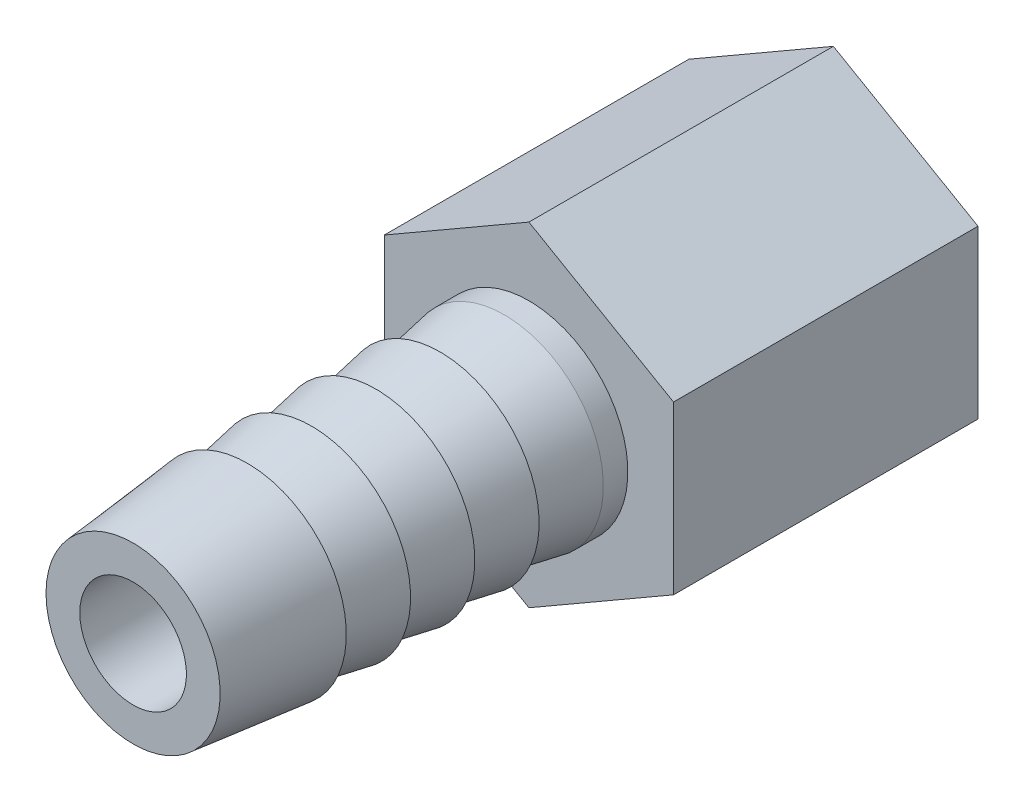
ISO-10303-21;
HEADER;
FILE_DESCRIPTION(('STEP AP214'),'2;1');
FILE_NAME('part.step','',(''),(''),'','','');
FILE_SCHEMA(('AUTOMOTIVE_DESIGN { 1 0 10303 214 1 1 1 1 }'));
ENDSEC;
DATA;
#1=APPLICATION_CONTEXT('core data for automotive mechanical design processes');
#2=APPLICATION_PROTOCOL_DEFINITION('international standard','automotive_design',2000,#1);
#3=PRODUCT_CONTEXT('',#1,'mechanical');
#4=PRODUCT('Part','Part','',(#3));
#5=PRODUCT_RELATED_PRODUCT_CATEGORY('part','',(#4));
#6=PRODUCT_DEFINITION_FORMATION('','',#4);
#7=PRODUCT_DEFINITION_CONTEXT('part definition',#1,'design');
#8=PRODUCT_DEFINITION('design','',#6,#7);
#9=PRODUCT_DEFINITION_SHAPE('','',#8);
#10=(LENGTH_UNIT() NAMED_UNIT(*) SI_UNIT(.MILLI.,.METRE.));
#11=(NAMED_UNIT(*) PLANE_ANGLE_UNIT() SI_UNIT($,.RADIAN.));
#12=(NAMED_UNIT(*) SI_UNIT($,.STERADIAN.) SOLID_ANGLE_UNIT());
#13=UNCERTAINTY_MEASURE_WITH_UNIT(LENGTH_MEASURE(1.E-05),#10,'distance_accuracy_value','');
#14=(GEOMETRIC_REPRESENTATION_CONTEXT(3) GLOBAL_UNCERTAINTY_ASSIGNED_CONTEXT((#13)) GLOBAL_UNIT_ASSIGNED_CONTEXT((#10,
#11,#12)) REPRESENTATION_CONTEXT('',''));
#15=CARTESIAN_POINT('',(0.,0.,0.));
#16=DIRECTION('',(0.,0.,1.));
#17=DIRECTION('',(1.,0.,0.));
#18=AXIS2_PLACEMENT_3D('',#15,#16,#17);
#19=CARTESIAN_POINT('',(0.,0.,20.));
#20=DIRECTION('',(0.,0.,-1.));
#21=DIRECTION('',(-1.,0.,0.));
#22=AXIS2_PLACEMENT_3D('',#19,#20,#21);
#23=CYLINDRICAL_SURFACE('',#22,3.5);
#24=CARTESIAN_POINT('',(0.,0.,46.));
#25=DIRECTION('',(0.,0.,-1.));
#26=DIRECTION('',(-1.,0.,0.));
#27=AXIS2_PLACEMENT_3D('',#24,#25,#26);
#28=CIRCLE('',#27,3.5);
#29=CARTESIAN_POINT('',(-3.5,0.,46.));
#30=VERTEX_POINT('',#29);
#31=EDGE_CURVE('P0_E57',#30,#30,#28,.T.);
#32=ORIENTED_EDGE('',*,*,#31,.F.);
#33=EDGE_LOOP('',(#32));
#34=FACE_BOUND('',#33,.T.);
#35=CARTESIAN_POINT('',(0.,0.,20.));
#36=DIRECTION('',(0.,0.,-1.));
#37=DIRECTION('',(-1.,0.,0.));
#38=AXIS2_PLACEMENT_3D('',#35,#36,#37);
#39=CIRCLE('',#38,3.5);
#40=CARTESIAN_POINT('',(-3.5,0.,20.));
#41=VERTEX_POINT('',#40);
#42=EDGE_CURVE('P0_E9',#41,#41,#39,.T.);
#43=ORIENTED_EDGE('',*,*,#42,.T.);
#44=EDGE_LOOP('',(#43));
#45=FACE_BOUND('',#44,.T.);
#46=ADVANCED_FACE('P0_F14',(#34,#45),#23,.F.);
#47=CARTESIAN_POINT('',(3.5,0.,20.));
#48=DIRECTION('',(0.,0.,1.));
#49=DIRECTION('',(1.,0.,0.));
#50=AXIS2_PLACEMENT_3D('',#47,#48,#49);
#51=PLANE('',#50);
#52=ORIENTED_EDGE('',*,*,#42,.F.);
#53=EDGE_LOOP('',(#52));
#54=FACE_BOUND('',#53,.T.);
#55=CARTESIAN_POINT('',(0.,0.,20.));
#56=DIRECTION('',(0.,0.,-1.));
#57=DIRECTION('',(-1.,0.,0.));
#58=AXIS2_PLACEMENT_3D('',#55,#56,#57);
#59=CIRCLE('',#58,6.5);
#60=CARTESIAN_POINT('',(-6.5,0.,20.));
#61=VERTEX_POINT('',#60);
#62=EDGE_CURVE('P0_E20',#61,#61,#59,.T.);
#63=ORIENTED_EDGE('',*,*,#62,.T.);
#64=EDGE_LOOP('',(#63));
#65=FACE_BOUND('',#64,.T.);
#66=ADVANCED_FACE('P0_F64',(#54,#65),#51,.F.);
#67=CARTESIAN_POINT('',(0.,0.,20.));
#68=DIRECTION('',(0.,0.,-1.));
#69=DIRECTION('',(-1.,0.,0.));
#70=AXIS2_PLACEMENT_3D('',#67,#68,#69);
#71=CYLINDRICAL_SURFACE('',#70,6.5);
#72=ORIENTED_EDGE('',*,*,#62,.F.);
#73=EDGE_LOOP('',(#72));
#74=FACE_BOUND('',#73,.T.);
#75=CARTESIAN_POINT('',(0.,0.,21.6089317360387));
#76=DIRECTION('',(0.,0.,-1.));
#77=DIRECTION('',(-1.,0.,0.));
#78=AXIS2_PLACEMENT_3D('',#75,#76,#77);
#79=CIRCLE('',#78,6.5);
#80=CARTESIAN_POINT('',(-6.5,0.,21.6089317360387));
#81=VERTEX_POINT('',#80);
#82=EDGE_CURVE('P0_E24',#81,#81,#79,.T.);
#83=ORIENTED_EDGE('',*,*,#82,.T.);
#84=EDGE_LOOP('',(#83));
#85=FACE_BOUND('',#84,.T.);
#86=ADVANCED_FACE('P0_F70',(#74,#85),#71,.T.);
#87=CARTESIAN_POINT('',(0.,0.,25.8300197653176));
#88=DIRECTION('',(0.,0.,-1.));
#89=DIRECTION('',(-1.,0.,0.));
#90=AXIS2_PLACEMENT_3D('',#87,#88,#89);
#91=CONICAL_SURFACE('',#90,5.72063865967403,0.182578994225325);
#92=ORIENTED_EDGE('',*,*,#82,.F.);
#93=EDGE_LOOP('',(#92));
#94=FACE_BOUND('',#93,.T.);
#95=CARTESIAN_POINT('',(0.,0.,25.8300197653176));
#96=DIRECTION('',(0.,0.,-1.));
#97=DIRECTION('',(-1.,0.,0.));
#98=AXIS2_PLACEMENT_3D('',#95,#96,#97);
#99=CIRCLE('',#98,5.72063865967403);
#100=CARTESIAN_POINT('',(-5.72063865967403,0.,25.8300197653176));
#101=VERTEX_POINT('',#100);
#102=EDGE_CURVE('P0_E28',#101,#101,#99,.T.);
#103=ORIENTED_EDGE('',*,*,#102,.T.);
#104=EDGE_LOOP('',(#103));
#105=FACE_BOUND('',#104,.T.);
#106=ADVANCED_FACE('P0_F76',(#94,#105),#91,.T.);
#107=CARTESIAN_POINT('',(5.72063865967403,0.,25.8300197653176));
#108=DIRECTION('',(0.,0.,1.));
#109=DIRECTION('',(1.,0.,0.));
#110=AXIS2_PLACEMENT_3D('',#107,#108,#109);
#111=PLANE('',#110);
#112=ORIENTED_EDGE('',*,*,#102,.F.);
#113=EDGE_LOOP('',(#112));
#114=FACE_BOUND('',#113,.T.);
#115=CARTESIAN_POINT('',(0.,0.,25.8300197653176));
#116=DIRECTION('',(0.,0.,-1.));
#117=DIRECTION('',(-1.,0.,0.));
#118=AXIS2_PLACEMENT_3D('',#115,#116,#117);
#119=CIRCLE('',#118,6.5);
#120=CARTESIAN_POINT('',(-6.5,0.,25.8300197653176));
#121=VERTEX_POINT('',#120);
#122=EDGE_CURVE('P0_E33',#121,#121,#119,.T.);
#123=ORIENTED_EDGE('',*,*,#122,.T.);
#124=EDGE_LOOP('',(#123));
#125=FACE_BOUND('',#124,.T.);
#126=ADVANCED_FACE('P0_F82',(#114,#125),#111,.F.);
#127=CARTESIAN_POINT('',(0.,0.,30.0511077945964));
#128=DIRECTION('',(0.,0.,-1.));
#129=DIRECTION('',(-1.,0.,0.));
#130=AXIS2_PLACEMENT_3D('',#127,#128,#129);
#131=CONICAL_SURFACE('',#130,5.72063865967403,0.182578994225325);
#132=ORIENTED_EDGE('',*,*,#122,.F.);
#133=EDGE_LOOP('',(#132));
#134=FACE_BOUND('',#133,.T.);
#135=CARTESIAN_POINT('',(0.,0.,30.0511077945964));
#136=DIRECTION('',(0.,0.,-1.));
#137=DIRECTION('',(-1.,0.,0.));
#138=AXIS2_PLACEMENT_3D('',#135,#136,#137);
#139=CIRCLE('',#138,5.72063865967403);
#140=CARTESIAN_POINT('',(-5.72063865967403,0.,30.0511077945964));
#141=VERTEX_POINT('',#140);
#142=EDGE_CURVE('P0_E36',#141,#141,#139,.T.);
#143=ORIENTED_EDGE('',*,*,#142,.T.);
#144=EDGE_LOOP('',(#143));
#145=FACE_BOUND('',#144,.T.);
#146=ADVANCED_FACE('P0_F86',(#134,#145),#131,.T.);
#147=CARTESIAN_POINT('',(5.72063865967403,0.,30.0511077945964));
#148=DIRECTION('',(0.,0.,1.));
#149=DIRECTION('',(1.,0.,0.));
#150=AXIS2_PLACEMENT_3D('',#147,#148,#149);
#151=PLANE('',#150);
#152=ORIENTED_EDGE('',*,*,#142,.F.);
#153=EDGE_LOOP('',(#152));
#154=FACE_BOUND('',#153,.T.);
#155=CARTESIAN_POINT('',(0.,0.,30.0511077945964));
#156=DIRECTION('',(0.,0.,-1.));
#157=DIRECTION('',(-1.,0.,0.));
#158=AXIS2_PLACEMENT_3D('',#155,#156,#157);
#159=CIRCLE('',#158,6.5);
#160=CARTESIAN_POINT('',(-6.5,0.,30.0511077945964));
#161=VERTEX_POINT('',#160);
#162=EDGE_CURVE('P0_E39',#161,#161,#159,.T.);
#163=ORIENTED_EDGE('',*,*,#162,.T.);
#164=EDGE_LOOP('',(#163));
#165=FACE_BOUND('',#164,.T.);
#166=ADVANCED_FACE('P0_F90',(#154,#165),#151,.F.);
#167=CARTESIAN_POINT('',(0.,0.,34.2721958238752));
#168=DIRECTION('',(0.,0.,-1.));
#169=DIRECTION('',(-1.,0.,0.));
#170=AXIS2_PLACEMENT_3D('',#167,#168,#169);
#171=CONICAL_SURFACE('',#170,5.72063865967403,0.182578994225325);
#172=ORIENTED_EDGE('',*,*,#162,.F.);
#173=EDGE_LOOP('',(#172));
#174=FACE_BOUND('',#173,.T.);
#175=CARTESIAN_POINT('',(0.,0.,34.2721958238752));
#176=DIRECTION('',(0.,0.,-1.));
#177=DIRECTION('',(-1.,0.,0.));
#178=AXIS2_PLACEMENT_3D('',#175,#176,#177);
#179=CIRCLE('',#178,5.72063865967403);
#180=CARTESIAN_POINT('',(-5.72063865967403,0.,34.2721958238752));
#181=VERTEX_POINT('',#180);
#182=EDGE_CURVE('P0_E42',#181,#181,#179,.T.);
#183=ORIENTED_EDGE('',*,*,#182,.T.);
#184=EDGE_LOOP('',(#183));
#185=FACE_BOUND('',#184,.T.);
#186=ADVANCED_FACE('P0_F94',(#174,#185),#171,.T.);
#187=CARTESIAN_POINT('',(5.72063865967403,0.,34.2721958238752));
#188=DIRECTION('',(0.,0.,1.));
#189=DIRECTION('',(1.,0.,0.));
#190=AXIS2_PLACEMENT_3D('',#187,#188,#189);
#191=PLANE('',#190);
#192=ORIENTED_EDGE('',*,*,#182,.F.);
#193=EDGE_LOOP('',(#192));
#194=FACE_BOUND('',#193,.T.);
#195=CARTESIAN_POINT('',(0.,0.,34.2721958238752));
#196=DIRECTION('',(0.,0.,-1.));
#197=DIRECTION('',(-1.,0.,0.));
#198=AXIS2_PLACEMENT_3D('',#195,#196,#197);
#199=CIRCLE('',#198,6.5);
#200=CARTESIAN_POINT('',(-6.5,0.,34.2721958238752));
#201=VERTEX_POINT('',#200);
#202=EDGE_CURVE('P0_E45',#201,#201,#199,.T.);
#203=ORIENTED_EDGE('',*,*,#202,.T.);
#204=EDGE_LOOP('',(#203));
#205=FACE_BOUND('',#204,.T.);
#206=ADVANCED_FACE('P0_F98',(#194,#205),#191,.F.);
#207=CARTESIAN_POINT('',(0.,0.,38.493283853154));
#208=DIRECTION('',(0.,0.,-1.));
#209=DIRECTION('',(-1.,0.,0.));
#210=AXIS2_PLACEMENT_3D('',#207,#208,#209);
#211=CONICAL_SURFACE('',#210,5.72063865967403,0.182578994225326);
#212=ORIENTED_EDGE('',*,*,#202,.F.);
#213=EDGE_LOOP('',(#212));
#214=FACE_BOUND('',#213,.T.);
#215=CARTESIAN_POINT('',(0.,0.,38.493283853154));
#216=DIRECTION('',(0.,0.,-1.));
#217=DIRECTION('',(-1.,0.,0.));
#218=AXIS2_PLACEMENT_3D('',#215,#216,#217);
#219=CIRCLE('',#218,5.72063865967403);
#220=CARTESIAN_POINT('',(-5.72063865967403,0.,38.493283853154));
#221=VERTEX_POINT('',#220);
#222=EDGE_CURVE('P0_E48',#221,#221,#219,.T.);
#223=ORIENTED_EDGE('',*,*,#222,.T.);
#224=EDGE_LOOP('',(#223));
#225=FACE_BOUND('',#224,.T.);
#226=ADVANCED_FACE('P0_F102',(#214,#225),#211,.T.);
#227=CARTESIAN_POINT('',(5.72063865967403,0.,38.493283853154));
#228=DIRECTION('',(0.,0.,1.));
#229=DIRECTION('',(1.,0.,0.));
#230=AXIS2_PLACEMENT_3D('',#227,#228,#229);
#231=PLANE('',#230);
#232=ORIENTED_EDGE('',*,*,#222,.F.);
#233=EDGE_LOOP('',(#232));
#234=FACE_BOUND('',#233,.T.);
#235=CARTESIAN_POINT('',(0.,0.,38.493283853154));
#236=DIRECTION('',(0.,0.,-1.));
#237=DIRECTION('',(-1.,0.,0.));
#238=AXIS2_PLACEMENT_3D('',#235,#236,#237);
#239=CIRCLE('',#238,6.5);
#240=CARTESIAN_POINT('',(-6.5,0.,38.493283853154));
#241=VERTEX_POINT('',#240);
#242=EDGE_CURVE('P0_E51',#241,#241,#239,.T.);
#243=ORIENTED_EDGE('',*,*,#242,.T.);
#244=EDGE_LOOP('',(#243));
#245=FACE_BOUND('',#244,.T.);
#246=ADVANCED_FACE('P0_F106',(#234,#245),#231,.F.);
#247=CARTESIAN_POINT('',(0.,0.,46.));
#248=DIRECTION('',(0.,0.,-1.));
#249=DIRECTION('',(-1.,0.,0.));
#250=AXIS2_PLACEMENT_3D('',#247,#248,#249);
#251=CONICAL_SURFACE('',#250,5.72063865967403,0.103451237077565);
#252=ORIENTED_EDGE('',*,*,#242,.F.);
#253=EDGE_LOOP('',(#252));
#254=FACE_BOUND('',#253,.T.);
#255=CARTESIAN_POINT('',(0.,0.,46.));
#256=DIRECTION('',(0.,0.,-1.));
#257=DIRECTION('',(-1.,0.,0.));
#258=AXIS2_PLACEMENT_3D('',#255,#256,#257);
#259=CIRCLE('',#258,5.72063865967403);
#260=CARTESIAN_POINT('',(-5.72063865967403,0.,46.));
#261=VERTEX_POINT('',#260);
#262=EDGE_CURVE('P0_E54',#261,#261,#259,.T.);
#263=ORIENTED_EDGE('',*,*,#262,.T.);
#264=EDGE_LOOP('',(#263));
#265=FACE_BOUND('',#264,.T.);
#266=ADVANCED_FACE('P0_F110',(#254,#265),#251,.T.);
#267=CARTESIAN_POINT('',(5.72063865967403,0.,46.));
#268=DIRECTION('',(0.,0.,-1.));
#269=DIRECTION('',(-1.,0.,0.));
#270=AXIS2_PLACEMENT_3D('',#267,#268,#269);
#271=PLANE('',#270);
#272=ORIENTED_EDGE('',*,*,#262,.F.);
#273=EDGE_LOOP('',(#272));
#274=FACE_BOUND('',#273,.T.);
#275=ORIENTED_EDGE('',*,*,#31,.T.);
#276=EDGE_LOOP('',(#275));
#277=FACE_BOUND('',#276,.T.);
#278=ADVANCED_FACE('P0_F61',(#274,#277),#271,.F.);
#279=CLOSED_SHELL('',(#46,#66,#86,#106,#126,#146,#166,#186,#206,#226,#246,#266,#278));
#280=MANIFOLD_SOLID_BREP('P0_B1',#279);
#281=CARTESIAN_POINT('',(0.,0.,20.));
#282=DIRECTION('',(0.,0.,1.));
#283=DIRECTION('',(1.,0.,0.));
#284=AXIS2_PLACEMENT_3D('',#281,#282,#283);
#285=PLANE('',#284);
#286=DIRECTION('',(-0.866025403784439,0.5,0.));
#287=VECTOR('',#286,1.);
#288=CARTESIAN_POINT('',(9.5,5.48482755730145,20.));
#289=LINE('',#288,#287);
#290=CARTESIAN_POINT('',(9.5,5.48482755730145,20.));
#291=VERTEX_POINT('',#290);
#292=CARTESIAN_POINT('',(0.,10.9696551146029,20.));
#293=VERTEX_POINT('',#292);
#294=EDGE_CURVE('P1_E114',#291,#293,#289,.T.);
#295=ORIENTED_EDGE('',*,*,#294,.T.);
#296=DIRECTION('',(-0.866025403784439,-0.5,0.));
#297=VECTOR('',#296,1.);
#298=CARTESIAN_POINT('',(0.,10.9696551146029,20.));
#299=LINE('',#298,#297);
#300=CARTESIAN_POINT('',(-9.5,5.48482755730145,20.));
#301=VERTEX_POINT('',#300);
#302=EDGE_CURVE('P1_E72',#293,#301,#299,.T.);
#303=ORIENTED_EDGE('',*,*,#302,.T.);
#304=DIRECTION('',(0.,-1.,0.));
#305=VECTOR('',#304,1.);
#306=CARTESIAN_POINT('',(-9.5,5.48482755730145,20.));
#307=LINE('',#306,#305);
#308=CARTESIAN_POINT('',(-9.5,-5.48482755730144,20.));
#309=VERTEX_POINT('',#308);
#310=EDGE_CURVE('P1_E85',#301,#309,#307,.T.);
#311=ORIENTED_EDGE('',*,*,#310,.T.);
#312=DIRECTION('',(0.866025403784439,-0.5,0.));
#313=VECTOR('',#312,1.);
#314=CARTESIAN_POINT('',(-9.5,-5.48482755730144,20.));
#315=LINE('',#314,#313);
#316=CARTESIAN_POINT('',(0.,-10.9696551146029,20.));
#317=VERTEX_POINT('',#316);
#318=EDGE_CURVE('P1_E79',#309,#317,#315,.T.);
#319=ORIENTED_EDGE('',*,*,#318,.T.);
#320=DIRECTION('',(0.866025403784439,0.5,0.));
#321=VECTOR('',#320,1.);
#322=CARTESIAN_POINT('',(0.,-10.9696551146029,20.));
#323=LINE('',#322,#321);
#324=CARTESIAN_POINT('',(9.5,-5.48482755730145,20.));
#325=VERTEX_POINT('',#324);
#326=EDGE_CURVE('P1_E83',#317,#325,#323,.T.);
#327=ORIENTED_EDGE('',*,*,#326,.T.);
#328=DIRECTION('',(0.,1.,0.));
#329=VECTOR('',#328,1.);
#330=CARTESIAN_POINT('',(9.5,-5.48482755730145,20.));
#331=LINE('',#330,#329);
#332=EDGE_CURVE('P1_E34',#325,#291,#331,.T.);
#333=ORIENTED_EDGE('',*,*,#332,.T.);
#334=EDGE_LOOP('',(#295,#303,#311,#319,#327,#333));
#335=FACE_BOUND('',#334,.T.);
#336=CARTESIAN_POINT('',(0.,0.,20.));
#337=DIRECTION('',(0.,0.,-1.));
#338=DIRECTION('',(-1.,0.,0.));
#339=AXIS2_PLACEMENT_3D('',#336,#337,#338);
#340=CIRCLE('',#339,6.5);
#341=CARTESIAN_POINT('',(-6.5,0.,20.));
#342=VERTEX_POINT('',#341);
#343=EDGE_CURVE('P1_E137',#342,#342,#340,.T.);
#344=ORIENTED_EDGE('',*,*,#343,.T.);
#345=EDGE_LOOP('',(#344));
#346=FACE_BOUND('',#345,.T.);
#347=ADVANCED_FACE('P1_F17',(#335,#346),#285,.T.);
#348=CARTESIAN_POINT('',(0.,0.,0.));
#349=DIRECTION('',(0.,0.,1.));
#350=DIRECTION('',(1.,0.,0.));
#351=AXIS2_PLACEMENT_3D('',#348,#349,#350);
#352=PLANE('',#351);
#353=DIRECTION('',(-0.866025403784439,0.5,0.));
#354=VECTOR('',#353,1.);
#355=CARTESIAN_POINT('',(9.5,5.48482755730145,0.));
#356=LINE('',#355,#354);
#357=CARTESIAN_POINT('',(9.5,5.48482755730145,0.));
#358=VERTEX_POINT('',#357);
#359=CARTESIAN_POINT('',(0.,10.9696551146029,0.));
#360=VERTEX_POINT('',#359);
#361=EDGE_CURVE('P1_E103',#358,#360,#356,.T.);
#362=ORIENTED_EDGE('',*,*,#361,.F.);
#363=DIRECTION('',(0.,1.,0.));
#364=VECTOR('',#363,1.);
#365=CARTESIAN_POINT('',(9.5,-5.48482755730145,0.));
#366=LINE('',#365,#364);
#367=CARTESIAN_POINT('',(9.5,-5.48482755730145,0.));
#368=VERTEX_POINT('',#367);
#369=EDGE_CURVE('P1_E63',#368,#358,#366,.T.);
#370=ORIENTED_EDGE('',*,*,#369,.F.);
#371=DIRECTION('',(0.866025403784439,0.5,0.));
#372=VECTOR('',#371,1.);
#373=CARTESIAN_POINT('',(0.,-10.9696551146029,0.));
#374=LINE('',#373,#372);
#375=CARTESIAN_POINT('',(0.,-10.9696551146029,0.));
#376=VERTEX_POINT('',#375);
#377=EDGE_CURVE('P1_E57',#376,#368,#374,.T.);
#378=ORIENTED_EDGE('',*,*,#377,.F.);
#379=DIRECTION('',(0.866025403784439,-0.5,0.));
#380=VECTOR('',#379,1.);
#381=CARTESIAN_POINT('',(-9.5,-5.48482755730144,0.));
#382=LINE('',#381,#380);
#383=CARTESIAN_POINT('',(-9.5,-5.48482755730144,0.));
#384=VERTEX_POINT('',#383);
#385=EDGE_CURVE('P1_E93',#384,#376,#382,.T.);
#386=ORIENTED_EDGE('',*,*,#385,.F.);
#387=DIRECTION('',(0.,-1.,0.));
#388=VECTOR('',#387,1.);
#389=CARTESIAN_POINT('',(-9.5,5.48482755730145,0.));
#390=LINE('',#389,#388);
#391=CARTESIAN_POINT('',(-9.5,5.48482755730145,0.));
#392=VERTEX_POINT('',#391);
#393=EDGE_CURVE('P1_E109',#392,#384,#390,.T.);
#394=ORIENTED_EDGE('',*,*,#393,.F.);
#395=DIRECTION('',(-0.866025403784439,-0.5,0.));
#396=VECTOR('',#395,1.);
#397=CARTESIAN_POINT('',(0.,10.9696551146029,0.));
#398=LINE('',#397,#396);
#399=EDGE_CURVE('P1_E106',#360,#392,#398,.T.);
#400=ORIENTED_EDGE('',*,*,#399,.F.);
#401=EDGE_LOOP('',(#362,#370,#378,#386,#394,#400));
#402=FACE_BOUND('',#401,.T.);
#403=CARTESIAN_POINT('',(0.,0.,0.));
#404=DIRECTION('',(0.,0.,1.));
#405=DIRECTION('',(1.,0.,0.));
#406=AXIS2_PLACEMENT_3D('',#403,#404,#405);
#407=CIRCLE('',#406,8.331);
#408=CARTESIAN_POINT('',(8.331,0.,0.));
#409=VERTEX_POINT('',#408);
#410=EDGE_CURVE('P1_E107',#409,#409,#407,.T.);
#411=ORIENTED_EDGE('',*,*,#410,.T.);
#412=EDGE_LOOP('',(#411));
#413=FACE_BOUND('',#412,.T.);
#414=ADVANCED_FACE('P1_F126',(#402,#413),#352,.F.);
#415=CARTESIAN_POINT('',(9.5,5.48482755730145,20.));
#416=DIRECTION('',(-0.5,-0.866025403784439,0.));
#417=DIRECTION('',(0.866025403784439,-0.5,0.));
#418=AXIS2_PLACEMENT_3D('',#415,#416,#417);
#419=PLANE('',#418);
#420=ORIENTED_EDGE('',*,*,#361,.T.);
#421=DIRECTION('',(0.,0.,-1.));
#422=VECTOR('',#421,1.);
#423=CARTESIAN_POINT('',(0.,10.9696551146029,20.));
#424=LINE('',#423,#422);
#425=EDGE_CURVE('P1_E26',#293,#360,#424,.T.);
#426=ORIENTED_EDGE('',*,*,#425,.F.);
#427=ORIENTED_EDGE('',*,*,#294,.F.);
#428=DIRECTION('',(0.,0.,-1.));
#429=VECTOR('',#428,1.);
#430=CARTESIAN_POINT('',(9.5,5.48482755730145,20.));
#431=LINE('',#430,#429);
#432=EDGE_CURVE('P1_E99',#291,#358,#431,.T.);
#433=ORIENTED_EDGE('',*,*,#432,.T.);
#434=EDGE_LOOP('',(#420,#426,#427,#433));
#435=FACE_BOUND('',#434,.T.);
#436=ADVANCED_FACE('P1_F19',(#435),#419,.F.);
#437=CARTESIAN_POINT('',(0.,10.9696551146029,20.));
#438=DIRECTION('',(0.5,-0.866025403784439,0.));
#439=DIRECTION('',(0.866025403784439,0.5,0.));
#440=AXIS2_PLACEMENT_3D('',#437,#438,#439);
#441=PLANE('',#440);
#442=ORIENTED_EDGE('',*,*,#399,.T.);
#443=DIRECTION('',(0.,0.,-1.));
#444=VECTOR('',#443,1.);
#445=CARTESIAN_POINT('',(-9.5,5.48482755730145,20.));
#446=LINE('',#445,#444);
#447=EDGE_CURVE('P1_E118',#301,#392,#446,.T.);
#448=ORIENTED_EDGE('',*,*,#447,.F.);
#449=ORIENTED_EDGE('',*,*,#302,.F.);
#450=ORIENTED_EDGE('',*,*,#425,.T.);
#451=EDGE_LOOP('',(#442,#448,#449,#450));
#452=FACE_BOUND('',#451,.T.);
#453=ADVANCED_FACE('P1_F121',(#452),#441,.F.);
#454=CARTESIAN_POINT('',(-9.5,5.48482755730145,20.));
#455=DIRECTION('',(1.,0.,0.));
#456=DIRECTION('',(0.,0.,-1.));
#457=AXIS2_PLACEMENT_3D('',#454,#455,#456);
#458=PLANE('',#457);
#459=ORIENTED_EDGE('',*,*,#393,.T.);
#460=DIRECTION('',(0.,0.,-1.));
#461=VECTOR('',#460,1.);
#462=CARTESIAN_POINT('',(-9.5,-5.48482755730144,20.));
#463=LINE('',#462,#461);
#464=EDGE_CURVE('P1_E94',#309,#384,#463,.T.);
#465=ORIENTED_EDGE('',*,*,#464,.F.);
#466=ORIENTED_EDGE('',*,*,#310,.F.);
#467=ORIENTED_EDGE('',*,*,#447,.T.);
#468=EDGE_LOOP('',(#459,#465,#466,#467));
#469=FACE_BOUND('',#468,.T.);
#470=ADVANCED_FACE('P1_F130',(#469),#458,.F.);
#471=CARTESIAN_POINT('',(-9.5,-5.48482755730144,20.));
#472=DIRECTION('',(0.5,0.866025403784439,0.));
#473=DIRECTION('',(-0.866025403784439,0.5,0.));
#474=AXIS2_PLACEMENT_3D('',#471,#472,#473);
#475=PLANE('',#474);
#476=ORIENTED_EDGE('',*,*,#385,.T.);
#477=DIRECTION('',(0.,0.,-1.));
#478=VECTOR('',#477,1.);
#479=CARTESIAN_POINT('',(0.,-10.9696551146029,20.));
#480=LINE('',#479,#478);
#481=EDGE_CURVE('P1_E90',#317,#376,#480,.T.);
#482=ORIENTED_EDGE('',*,*,#481,.F.);
#483=ORIENTED_EDGE('',*,*,#318,.F.);
#484=ORIENTED_EDGE('',*,*,#464,.T.);
#485=EDGE_LOOP('',(#476,#482,#483,#484));
#486=FACE_BOUND('',#485,.T.);
#487=ADVANCED_FACE('P1_F91',(#486),#475,.F.);
#488=CARTESIAN_POINT('',(0.,-10.9696551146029,20.));
#489=DIRECTION('',(-0.5,0.866025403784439,0.));
#490=DIRECTION('',(-0.866025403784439,-0.5,0.));
#491=AXIS2_PLACEMENT_3D('',#488,#489,#490);
#492=PLANE('',#491);
#493=ORIENTED_EDGE('',*,*,#377,.T.);
#494=DIRECTION('',(0.,0.,-1.));
#495=VECTOR('',#494,1.);
#496=CARTESIAN_POINT('',(9.5,-5.48482755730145,20.));
#497=LINE('',#496,#495);
#498=EDGE_CURVE('P1_E95',#325,#368,#497,.T.);
#499=ORIENTED_EDGE('',*,*,#498,.F.);
#500=ORIENTED_EDGE('',*,*,#326,.F.);
#501=ORIENTED_EDGE('',*,*,#481,.T.);
#502=EDGE_LOOP('',(#493,#499,#500,#501));
#503=FACE_BOUND('',#502,.T.);
#504=ADVANCED_FACE('P1_F97',(#503),#492,.F.);
#505=CARTESIAN_POINT('',(9.5,-5.48482755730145,20.));
#506=DIRECTION('',(-1.,0.,0.));
#507=DIRECTION('',(0.,-1.,0.));
#508=AXIS2_PLACEMENT_3D('',#505,#506,#507);
#509=PLANE('',#508);
#510=ORIENTED_EDGE('',*,*,#369,.T.);
#511=ORIENTED_EDGE('',*,*,#432,.F.);
#512=ORIENTED_EDGE('',*,*,#332,.F.);
#513=ORIENTED_EDGE('',*,*,#498,.T.);
#514=EDGE_LOOP('',(#510,#511,#512,#513));
#515=FACE_BOUND('',#514,.T.);
#516=ADVANCED_FACE('P1_F158',(#515),#509,.F.);
#517=CARTESIAN_POINT('',(0.,0.,20.));
#518=DIRECTION('',(0.,0.,-1.));
#519=DIRECTION('',(-1.,0.,0.));
#520=AXIS2_PLACEMENT_3D('',#517,#518,#519);
#521=CYLINDRICAL_SURFACE('',#520,8.331);
#522=CARTESIAN_POINT('',(0.,0.,19.9));
#523=DIRECTION('',(0.,0.,-1.));
#524=DIRECTION('',(-1.,0.,0.));
#525=AXIS2_PLACEMENT_3D('',#522,#523,#524);
#526=CIRCLE('',#525,8.331);
#527=CARTESIAN_POINT('',(-8.331,0.,19.9));
#528=VERTEX_POINT('',#527);
#529=EDGE_CURVE('P1_E11',#528,#528,#526,.T.);
#530=ORIENTED_EDGE('',*,*,#529,.F.);
#531=EDGE_LOOP('',(#530));
#532=FACE_BOUND('',#531,.T.);
#533=ORIENTED_EDGE('',*,*,#410,.F.);
#534=EDGE_LOOP('',(#533));
#535=FACE_BOUND('',#534,.T.);
#536=ADVANCED_FACE('P1_F148',(#532,#535),#521,.F.);
#537=CARTESIAN_POINT('',(0.,0.,19.9));
#538=DIRECTION('',(0.,0.,-1.));
#539=DIRECTION('',(-1.,0.,0.));
#540=AXIS2_PLACEMENT_3D('',#537,#538,#539);
#541=PLANE('',#540);
#542=ORIENTED_EDGE('',*,*,#529,.T.);
#543=EDGE_LOOP('',(#542));
#544=FACE_BOUND('',#543,.T.);
#545=CARTESIAN_POINT('',(0.,0.,19.9));
#546=DIRECTION('',(0.,0.,-1.));
#547=DIRECTION('',(-1.,0.,0.));
#548=AXIS2_PLACEMENT_3D('',#545,#546,#547);
#549=CIRCLE('',#548,6.5);
#550=CARTESIAN_POINT('',(-6.5,0.,19.9));
#551=VERTEX_POINT('',#550);
#552=EDGE_CURVE('P1_E136',#551,#551,#549,.T.);
#553=ORIENTED_EDGE('',*,*,#552,.F.);
#554=EDGE_LOOP('',(#553));
#555=FACE_BOUND('',#554,.T.);
#556=ADVANCED_FACE('P1_F146',(#544,#555),#541,.T.);
#557=CARTESIAN_POINT('',(0.,0.,19.9));
#558=DIRECTION('',(0.,0.,1.));
#559=DIRECTION('',(1.,0.,0.));
#560=AXIS2_PLACEMENT_3D('',#557,#558,#559);
#561=CYLINDRICAL_SURFACE('',#560,6.5);
#562=ORIENTED_EDGE('',*,*,#552,.T.);
#563=EDGE_LOOP('',(#562));
#564=FACE_BOUND('',#563,.T.);
#565=ORIENTED_EDGE('',*,*,#343,.F.);
#566=EDGE_LOOP('',(#565));
#567=FACE_BOUND('',#566,.T.);
#568=ADVANCED_FACE('P1_F143',(#564,#567),#561,.F.);
#569=CLOSED_SHELL('',(#347,#414,#436,#453,#470,#487,#504,#516,#536,#556,#568));
#570=MANIFOLD_SOLID_BREP('P1_B1',#569);
#571=ADVANCED_BREP_SHAPE_REPRESENTATION('',(#18,#280,#570),#14);
#572=SHAPE_DEFINITION_REPRESENTATION(#9,#571);
ENDSEC;
END-ISO-10303-21;
